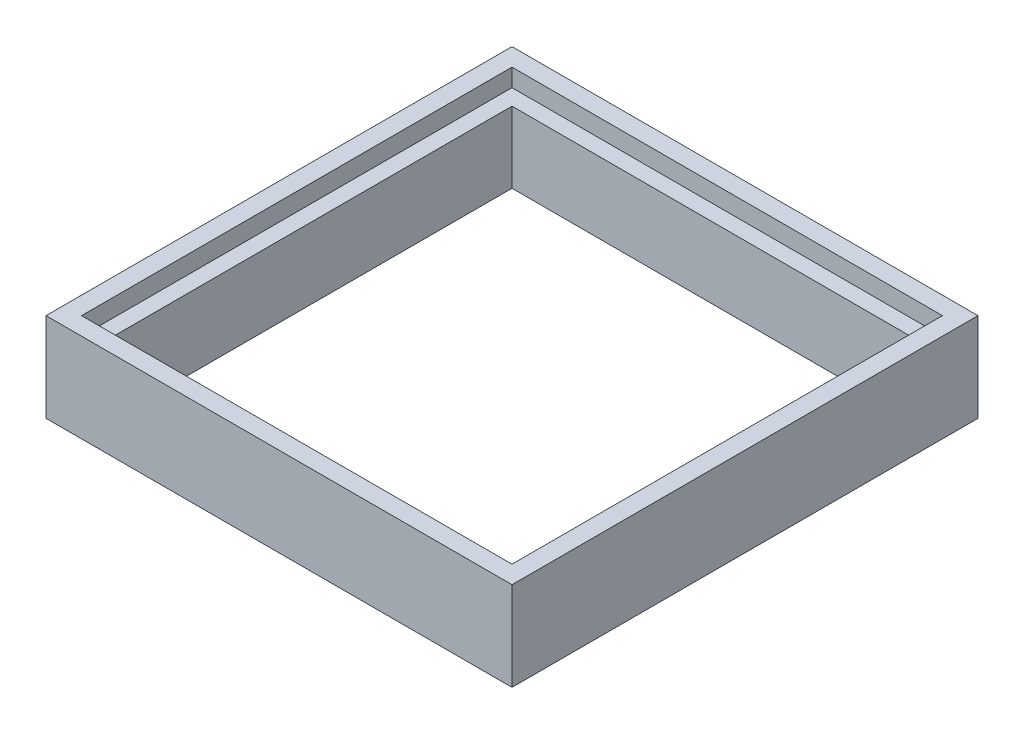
ISO-10303-21;
HEADER;
FILE_DESCRIPTION(('STEP AP214'),'2;1');
FILE_NAME('part.step','',(''),(''),'','','');
FILE_SCHEMA(('AUTOMOTIVE_DESIGN { 1 0 10303 214 1 1 1 1 }'));
ENDSEC;
DATA;
#1=APPLICATION_CONTEXT('core data for automotive mechanical design processes');
#2=APPLICATION_PROTOCOL_DEFINITION('international standard','automotive_design',2000,#1);
#3=PRODUCT_CONTEXT('',#1,'mechanical');
#4=PRODUCT('Part','Part','',(#3));
#5=PRODUCT_RELATED_PRODUCT_CATEGORY('part','',(#4));
#6=PRODUCT_DEFINITION_FORMATION('','',#4);
#7=PRODUCT_DEFINITION_CONTEXT('part definition',#1,'design');
#8=PRODUCT_DEFINITION('design','',#6,#7);
#9=PRODUCT_DEFINITION_SHAPE('','',#8);
#10=(LENGTH_UNIT() NAMED_UNIT(*) SI_UNIT(.MILLI.,.METRE.));
#11=(NAMED_UNIT(*) PLANE_ANGLE_UNIT() SI_UNIT($,.RADIAN.));
#12=(NAMED_UNIT(*) SI_UNIT($,.STERADIAN.) SOLID_ANGLE_UNIT());
#13=UNCERTAINTY_MEASURE_WITH_UNIT(LENGTH_MEASURE(1.E-05),#10,'distance_accuracy_value','');
#14=(GEOMETRIC_REPRESENTATION_CONTEXT(3) GLOBAL_UNCERTAINTY_ASSIGNED_CONTEXT((#13)) GLOBAL_UNIT_ASSIGNED_CONTEXT((#10,
#11,#12)) REPRESENTATION_CONTEXT('',''));
#15=CARTESIAN_POINT('',(0.,0.,0.));
#16=DIRECTION('',(0.,0.,1.));
#17=DIRECTION('',(1.,0.,0.));
#18=AXIS2_PLACEMENT_3D('',#15,#16,#17);
#19=CARTESIAN_POINT('',(14.,6.25,14.));
#20=DIRECTION('',(-1.,0.,0.));
#21=DIRECTION('',(0.,0.,1.));
#22=AXIS2_PLACEMENT_3D('',#19,#20,#21);
#23=PLANE('',#22);
#24=DIRECTION('',(0.,-1.,0.));
#25=VECTOR('',#24,1.);
#26=CARTESIAN_POINT('',(14.,6.25,14.));
#27=LINE('',#26,#25);
#28=CARTESIAN_POINT('',(14.,5.,14.));
#29=VERTEX_POINT('',#28);
#30=CARTESIAN_POINT('',(14.,0.,14.));
#31=VERTEX_POINT('',#30);
#32=EDGE_CURVE('E180',#29,#31,#27,.T.);
#33=ORIENTED_EDGE('',*,*,#32,.F.);
#34=DIRECTION('',(0.,0.,-1.));
#35=VECTOR('',#34,1.);
#36=CARTESIAN_POINT('',(14.,5.,14.));
#37=LINE('',#36,#35);
#38=CARTESIAN_POINT('',(14.,5.,-14.));
#39=VERTEX_POINT('',#38);
#40=EDGE_CURVE('E58',#29,#39,#37,.T.);
#41=ORIENTED_EDGE('',*,*,#40,.T.);
#42=DIRECTION('',(0.,-1.,0.));
#43=VECTOR('',#42,1.);
#44=CARTESIAN_POINT('',(14.,6.25,-14.));
#45=LINE('',#44,#43);
#46=CARTESIAN_POINT('',(14.,0.,-14.));
#47=VERTEX_POINT('',#46);
#48=EDGE_CURVE('E186',#39,#47,#45,.T.);
#49=ORIENTED_EDGE('',*,*,#48,.T.);
#50=DIRECTION('',(0.,0.,-1.));
#51=VECTOR('',#50,1.);
#52=CARTESIAN_POINT('',(14.,0.,14.));
#53=LINE('',#52,#51);
#54=EDGE_CURVE('E168',#31,#47,#53,.T.);
#55=ORIENTED_EDGE('',*,*,#54,.F.);
#56=EDGE_LOOP('',(#33,#41,#49,#55));
#57=FACE_BOUND('',#56,.T.);
#58=ADVANCED_FACE('F35',(#57),#23,.T.);
#59=CARTESIAN_POINT('',(-14.,6.25,-14.));
#60=DIRECTION('',(0.,0.,1.));
#61=DIRECTION('',(1.,0.,0.));
#62=AXIS2_PLACEMENT_3D('',#59,#60,#61);
#63=PLANE('',#62);
#64=ORIENTED_EDGE('',*,*,#48,.F.);
#65=DIRECTION('',(-1.,0.,0.));
#66=VECTOR('',#65,1.);
#67=CARTESIAN_POINT('',(-14.,5.,-14.));
#68=LINE('',#67,#66);
#69=CARTESIAN_POINT('',(-14.,5.,-14.));
#70=VERTEX_POINT('',#69);
#71=EDGE_CURVE('E164',#39,#70,#68,.T.);
#72=ORIENTED_EDGE('',*,*,#71,.T.);
#73=DIRECTION('',(0.,-1.,0.));
#74=VECTOR('',#73,1.);
#75=CARTESIAN_POINT('',(-14.,6.25,-14.));
#76=LINE('',#75,#74);
#77=CARTESIAN_POINT('',(-14.,0.,-14.));
#78=VERTEX_POINT('',#77);
#79=EDGE_CURVE('E184',#70,#78,#76,.T.);
#80=ORIENTED_EDGE('',*,*,#79,.T.);
#81=DIRECTION('',(-1.,0.,0.));
#82=VECTOR('',#81,1.);
#83=CARTESIAN_POINT('',(-14.,0.,-14.));
#84=LINE('',#83,#82);
#85=EDGE_CURVE('E171',#47,#78,#84,.T.);
#86=ORIENTED_EDGE('',*,*,#85,.F.);
#87=EDGE_LOOP('',(#64,#72,#80,#86));
#88=FACE_BOUND('',#87,.T.);
#89=ADVANCED_FACE('F251',(#88),#63,.T.);
#90=CARTESIAN_POINT('',(-14.,6.25,14.));
#91=DIRECTION('',(1.,0.,0.));
#92=DIRECTION('',(0.,0.,-1.));
#93=AXIS2_PLACEMENT_3D('',#90,#91,#92);
#94=PLANE('',#93);
#95=ORIENTED_EDGE('',*,*,#79,.F.);
#96=DIRECTION('',(0.,0.,1.));
#97=VECTOR('',#96,1.);
#98=CARTESIAN_POINT('',(-14.,5.,14.));
#99=LINE('',#98,#97);
#100=CARTESIAN_POINT('',(-14.,5.,14.));
#101=VERTEX_POINT('',#100);
#102=EDGE_CURVE('E158',#70,#101,#99,.T.);
#103=ORIENTED_EDGE('',*,*,#102,.T.);
#104=DIRECTION('',(0.,-1.,0.));
#105=VECTOR('',#104,1.);
#106=CARTESIAN_POINT('',(-14.,6.25,14.));
#107=LINE('',#106,#105);
#108=CARTESIAN_POINT('',(-14.,0.,14.));
#109=VERTEX_POINT('',#108);
#110=EDGE_CURVE('E182',#101,#109,#107,.T.);
#111=ORIENTED_EDGE('',*,*,#110,.T.);
#112=DIRECTION('',(0.,0.,1.));
#113=VECTOR('',#112,1.);
#114=CARTESIAN_POINT('',(-14.,0.,14.));
#115=LINE('',#114,#113);
#116=EDGE_CURVE('E174',#78,#109,#115,.T.);
#117=ORIENTED_EDGE('',*,*,#116,.F.);
#118=EDGE_LOOP('',(#95,#103,#111,#117));
#119=FACE_BOUND('',#118,.T.);
#120=ADVANCED_FACE('F246',(#119),#94,.T.);
#121=CARTESIAN_POINT('',(-14.,6.25,14.));
#122=DIRECTION('',(0.,0.,-1.));
#123=DIRECTION('',(-1.,0.,0.));
#124=AXIS2_PLACEMENT_3D('',#121,#122,#123);
#125=PLANE('',#124);
#126=ORIENTED_EDGE('',*,*,#110,.F.);
#127=DIRECTION('',(1.,0.,0.));
#128=VECTOR('',#127,1.);
#129=CARTESIAN_POINT('',(-14.,5.,14.));
#130=LINE('',#129,#128);
#131=EDGE_CURVE('E11',#101,#29,#130,.T.);
#132=ORIENTED_EDGE('',*,*,#131,.T.);
#133=ORIENTED_EDGE('',*,*,#32,.T.);
#134=DIRECTION('',(1.,0.,0.));
#135=VECTOR('',#134,1.);
#136=CARTESIAN_POINT('',(-14.,0.,14.));
#137=LINE('',#136,#135);
#138=EDGE_CURVE('E177',#109,#31,#137,.T.);
#139=ORIENTED_EDGE('',*,*,#138,.F.);
#140=EDGE_LOOP('',(#126,#132,#133,#139));
#141=FACE_BOUND('',#140,.T.);
#142=ADVANCED_FACE('F238',(#141),#125,.T.);
#143=CARTESIAN_POINT('',(0.,6.25,0.));
#144=DIRECTION('',(0.,-1.,0.));
#145=DIRECTION('',(0.,0.,-1.));
#146=AXIS2_PLACEMENT_3D('',#143,#144,#145);
#147=PLANE('',#146);
#148=DIRECTION('',(-1.,0.,0.));
#149=VECTOR('',#148,1.);
#150=CARTESIAN_POINT('',(15.125,6.25,-15.125));
#151=LINE('',#150,#149);
#152=CARTESIAN_POINT('',(15.125,6.25,-15.125));
#153=VERTEX_POINT('',#152);
#154=CARTESIAN_POINT('',(-15.125,6.25,-15.125));
#155=VERTEX_POINT('',#154);
#156=EDGE_CURVE('E152',#153,#155,#151,.T.);
#157=ORIENTED_EDGE('',*,*,#156,.F.);
#158=DIRECTION('',(0.,0.,-1.));
#159=VECTOR('',#158,1.);
#160=CARTESIAN_POINT('',(15.125,6.25,15.125));
#161=LINE('',#160,#159);
#162=CARTESIAN_POINT('',(15.125,6.25,15.125));
#163=VERTEX_POINT('',#162);
#164=EDGE_CURVE('E50',#163,#153,#161,.T.);
#165=ORIENTED_EDGE('',*,*,#164,.F.);
#166=DIRECTION('',(1.,0.,0.));
#167=VECTOR('',#166,1.);
#168=CARTESIAN_POINT('',(-15.125,6.25,15.125));
#169=LINE('',#168,#167);
#170=CARTESIAN_POINT('',(-15.125,6.25,15.125));
#171=VERTEX_POINT('',#170);
#172=EDGE_CURVE('E143',#171,#163,#169,.T.);
#173=ORIENTED_EDGE('',*,*,#172,.F.);
#174=DIRECTION('',(0.,0.,1.));
#175=VECTOR('',#174,1.);
#176=CARTESIAN_POINT('',(-15.125,6.25,-15.125));
#177=LINE('',#176,#175);
#178=EDGE_CURVE('E146',#155,#171,#177,.T.);
#179=ORIENTED_EDGE('',*,*,#178,.F.);
#180=EDGE_LOOP('',(#157,#165,#173,#179));
#181=FACE_BOUND('',#180,.T.);
#182=DIRECTION('',(0.,0.,1.));
#183=VECTOR('',#182,1.);
#184=CARTESIAN_POINT('',(-16.375,6.25,16.375));
#185=LINE('',#184,#183);
#186=CARTESIAN_POINT('',(-16.375,6.25,-16.375));
#187=VERTEX_POINT('',#186);
#188=CARTESIAN_POINT('',(-16.375,6.25,16.375));
#189=VERTEX_POINT('',#188);
#190=EDGE_CURVE('E189',#187,#189,#185,.T.);
#191=ORIENTED_EDGE('',*,*,#190,.T.);
#192=DIRECTION('',(1.,0.,0.));
#193=VECTOR('',#192,1.);
#194=CARTESIAN_POINT('',(-16.375,6.25,16.375));
#195=LINE('',#194,#193);
#196=CARTESIAN_POINT('',(16.375,6.25,16.375));
#197=VERTEX_POINT('',#196);
#198=EDGE_CURVE('E192',#189,#197,#195,.T.);
#199=ORIENTED_EDGE('',*,*,#198,.T.);
#200=DIRECTION('',(0.,0.,-1.));
#201=VECTOR('',#200,1.);
#202=CARTESIAN_POINT('',(16.375,6.25,16.375));
#203=LINE('',#202,#201);
#204=CARTESIAN_POINT('',(16.375,6.25,-16.375));
#205=VERTEX_POINT('',#204);
#206=EDGE_CURVE('E195',#197,#205,#203,.T.);
#207=ORIENTED_EDGE('',*,*,#206,.T.);
#208=DIRECTION('',(-1.,0.,0.));
#209=VECTOR('',#208,1.);
#210=CARTESIAN_POINT('',(-16.375,6.25,-16.375));
#211=LINE('',#210,#209);
#212=EDGE_CURVE('E197',#205,#187,#211,.T.);
#213=ORIENTED_EDGE('',*,*,#212,.T.);
#214=EDGE_LOOP('',(#191,#199,#207,#213));
#215=FACE_BOUND('',#214,.T.);
#216=ADVANCED_FACE('F236',(#181,#215),#147,.F.);
#217=CARTESIAN_POINT('',(0.,0.,0.));
#218=DIRECTION('',(0.,-1.,0.));
#219=DIRECTION('',(0.,0.,-1.));
#220=AXIS2_PLACEMENT_3D('',#217,#218,#219);
#221=PLANE('',#220);
#222=DIRECTION('',(0.,0.,1.));
#223=VECTOR('',#222,1.);
#224=CARTESIAN_POINT('',(-16.375,0.,16.375));
#225=LINE('',#224,#223);
#226=CARTESIAN_POINT('',(-16.375,0.,-16.375));
#227=VERTEX_POINT('',#226);
#228=CARTESIAN_POINT('',(-16.375,0.,16.375));
#229=VERTEX_POINT('',#228);
#230=EDGE_CURVE('E188',#227,#229,#225,.T.);
#231=ORIENTED_EDGE('',*,*,#230,.F.);
#232=DIRECTION('',(-1.,0.,0.));
#233=VECTOR('',#232,1.);
#234=CARTESIAN_POINT('',(-16.375,0.,-16.375));
#235=LINE('',#234,#233);
#236=CARTESIAN_POINT('',(16.375,0.,-16.375));
#237=VERTEX_POINT('',#236);
#238=EDGE_CURVE('E193',#237,#227,#235,.T.);
#239=ORIENTED_EDGE('',*,*,#238,.F.);
#240=DIRECTION('',(0.,0.,-1.));
#241=VECTOR('',#240,1.);
#242=CARTESIAN_POINT('',(16.375,0.,16.375));
#243=LINE('',#242,#241);
#244=CARTESIAN_POINT('',(16.375,0.,16.375));
#245=VERTEX_POINT('',#244);
#246=EDGE_CURVE('E204',#245,#237,#243,.T.);
#247=ORIENTED_EDGE('',*,*,#246,.F.);
#248=DIRECTION('',(1.,0.,0.));
#249=VECTOR('',#248,1.);
#250=CARTESIAN_POINT('',(-16.375,0.,16.375));
#251=LINE('',#250,#249);
#252=EDGE_CURVE('E202',#229,#245,#251,.T.);
#253=ORIENTED_EDGE('',*,*,#252,.F.);
#254=EDGE_LOOP('',(#231,#239,#247,#253));
#255=FACE_BOUND('',#254,.T.);
#256=ORIENTED_EDGE('',*,*,#138,.T.);
#257=ORIENTED_EDGE('',*,*,#54,.T.);
#258=ORIENTED_EDGE('',*,*,#85,.T.);
#259=ORIENTED_EDGE('',*,*,#116,.T.);
#260=EDGE_LOOP('',(#256,#257,#258,#259));
#261=FACE_BOUND('',#260,.T.);
#262=ADVANCED_FACE('F225',(#255,#261),#221,.T.);
#263=CARTESIAN_POINT('',(-16.375,6.25,16.375));
#264=DIRECTION('',(1.,0.,0.));
#265=DIRECTION('',(0.,0.,-1.));
#266=AXIS2_PLACEMENT_3D('',#263,#264,#265);
#267=PLANE('',#266);
#268=ORIENTED_EDGE('',*,*,#230,.T.);
#269=DIRECTION('',(0.,-1.,0.));
#270=VECTOR('',#269,1.);
#271=CARTESIAN_POINT('',(-16.375,6.25,16.375));
#272=LINE('',#271,#270);
#273=EDGE_CURVE('E43',#189,#229,#272,.T.);
#274=ORIENTED_EDGE('',*,*,#273,.F.);
#275=ORIENTED_EDGE('',*,*,#190,.F.);
#276=DIRECTION('',(0.,-1.,0.));
#277=VECTOR('',#276,1.);
#278=CARTESIAN_POINT('',(-16.375,6.25,-16.375));
#279=LINE('',#278,#277);
#280=EDGE_CURVE('E199',#187,#227,#279,.T.);
#281=ORIENTED_EDGE('',*,*,#280,.T.);
#282=EDGE_LOOP('',(#268,#274,#275,#281));
#283=FACE_BOUND('',#282,.T.);
#284=ADVANCED_FACE('F37',(#283),#267,.F.);
#285=CARTESIAN_POINT('',(-16.375,6.25,16.375));
#286=DIRECTION('',(0.,0.,-1.));
#287=DIRECTION('',(-1.,0.,0.));
#288=AXIS2_PLACEMENT_3D('',#285,#286,#287);
#289=PLANE('',#288);
#290=ORIENTED_EDGE('',*,*,#252,.T.);
#291=DIRECTION('',(0.,-1.,0.));
#292=VECTOR('',#291,1.);
#293=CARTESIAN_POINT('',(16.375,6.25,16.375));
#294=LINE('',#293,#292);
#295=EDGE_CURVE('E212',#197,#245,#294,.T.);
#296=ORIENTED_EDGE('',*,*,#295,.F.);
#297=ORIENTED_EDGE('',*,*,#198,.F.);
#298=ORIENTED_EDGE('',*,*,#273,.T.);
#299=EDGE_LOOP('',(#290,#296,#297,#298));
#300=FACE_BOUND('',#299,.T.);
#301=ADVANCED_FACE('F217',(#300),#289,.F.);
#302=CARTESIAN_POINT('',(16.375,6.25,16.375));
#303=DIRECTION('',(-1.,0.,0.));
#304=DIRECTION('',(0.,0.,1.));
#305=AXIS2_PLACEMENT_3D('',#302,#303,#304);
#306=PLANE('',#305);
#307=ORIENTED_EDGE('',*,*,#246,.T.);
#308=DIRECTION('',(0.,-1.,0.));
#309=VECTOR('',#308,1.);
#310=CARTESIAN_POINT('',(16.375,6.25,-16.375));
#311=LINE('',#310,#309);
#312=EDGE_CURVE('E209',#205,#237,#311,.T.);
#313=ORIENTED_EDGE('',*,*,#312,.F.);
#314=ORIENTED_EDGE('',*,*,#206,.F.);
#315=ORIENTED_EDGE('',*,*,#295,.T.);
#316=EDGE_LOOP('',(#307,#313,#314,#315));
#317=FACE_BOUND('',#316,.T.);
#318=ADVANCED_FACE('F230',(#317),#306,.F.);
#319=CARTESIAN_POINT('',(-16.375,6.25,-16.375));
#320=DIRECTION('',(0.,0.,1.));
#321=DIRECTION('',(1.,0.,0.));
#322=AXIS2_PLACEMENT_3D('',#319,#320,#321);
#323=PLANE('',#322);
#324=ORIENTED_EDGE('',*,*,#238,.T.);
#325=ORIENTED_EDGE('',*,*,#280,.F.);
#326=ORIENTED_EDGE('',*,*,#212,.F.);
#327=ORIENTED_EDGE('',*,*,#312,.T.);
#328=EDGE_LOOP('',(#324,#325,#326,#327));
#329=FACE_BOUND('',#328,.T.);
#330=ADVANCED_FACE('F234',(#329),#323,.F.);
#331=CARTESIAN_POINT('',(15.125,5.,15.125));
#332=DIRECTION('',(1.,0.,0.));
#333=DIRECTION('',(0.,0.,-1.));
#334=AXIS2_PLACEMENT_3D('',#331,#332,#333);
#335=PLANE('',#334);
#336=ORIENTED_EDGE('',*,*,#164,.T.);
#337=DIRECTION('',(0.,1.,0.));
#338=VECTOR('',#337,1.);
#339=CARTESIAN_POINT('',(15.125,5.,-15.125));
#340=LINE('',#339,#338);
#341=CARTESIAN_POINT('',(15.125,5.,-15.125));
#342=VERTEX_POINT('',#341);
#343=EDGE_CURVE('E121',#342,#153,#340,.T.);
#344=ORIENTED_EDGE('',*,*,#343,.F.);
#345=DIRECTION('',(0.,0.,-1.));
#346=VECTOR('',#345,1.);
#347=CARTESIAN_POINT('',(15.125,5.,15.125));
#348=LINE('',#347,#346);
#349=CARTESIAN_POINT('',(15.125,5.,15.125));
#350=VERTEX_POINT('',#349);
#351=EDGE_CURVE('E125',#350,#342,#348,.T.);
#352=ORIENTED_EDGE('',*,*,#351,.F.);
#353=DIRECTION('',(0.,1.,0.));
#354=VECTOR('',#353,1.);
#355=CARTESIAN_POINT('',(15.125,5.,15.125));
#356=LINE('',#355,#354);
#357=EDGE_CURVE('E156',#350,#163,#356,.T.);
#358=ORIENTED_EDGE('',*,*,#357,.T.);
#359=EDGE_LOOP('',(#336,#344,#352,#358));
#360=FACE_BOUND('',#359,.T.);
#361=ADVANCED_FACE('F123',(#360),#335,.F.);
#362=CARTESIAN_POINT('',(-15.125,5.,15.125));
#363=DIRECTION('',(0.,0.,1.));
#364=DIRECTION('',(1.,0.,0.));
#365=AXIS2_PLACEMENT_3D('',#362,#363,#364);
#366=PLANE('',#365);
#367=ORIENTED_EDGE('',*,*,#172,.T.);
#368=ORIENTED_EDGE('',*,*,#357,.F.);
#369=DIRECTION('',(1.,0.,0.));
#370=VECTOR('',#369,1.);
#371=CARTESIAN_POINT('',(-15.125,5.,15.125));
#372=LINE('',#371,#370);
#373=CARTESIAN_POINT('',(-15.125,5.,15.125));
#374=VERTEX_POINT('',#373);
#375=EDGE_CURVE('E131',#374,#350,#372,.T.);
#376=ORIENTED_EDGE('',*,*,#375,.F.);
#377=DIRECTION('',(0.,1.,0.));
#378=VECTOR('',#377,1.);
#379=CARTESIAN_POINT('',(-15.125,5.,15.125));
#380=LINE('',#379,#378);
#381=EDGE_CURVE('E159',#374,#171,#380,.T.);
#382=ORIENTED_EDGE('',*,*,#381,.T.);
#383=EDGE_LOOP('',(#367,#368,#376,#382));
#384=FACE_BOUND('',#383,.T.);
#385=ADVANCED_FACE('F265',(#384),#366,.F.);
#386=CARTESIAN_POINT('',(-15.125,5.,-15.125));
#387=DIRECTION('',(-1.,0.,0.));
#388=DIRECTION('',(0.,0.,1.));
#389=AXIS2_PLACEMENT_3D('',#386,#387,#388);
#390=PLANE('',#389);
#391=ORIENTED_EDGE('',*,*,#178,.T.);
#392=ORIENTED_EDGE('',*,*,#381,.F.);
#393=DIRECTION('',(0.,0.,1.));
#394=VECTOR('',#393,1.);
#395=CARTESIAN_POINT('',(-15.125,5.,-15.125));
#396=LINE('',#395,#394);
#397=CARTESIAN_POINT('',(-15.125,5.,-15.125));
#398=VERTEX_POINT('',#397);
#399=EDGE_CURVE('E139',#398,#374,#396,.T.);
#400=ORIENTED_EDGE('',*,*,#399,.F.);
#401=DIRECTION('',(0.,1.,0.));
#402=VECTOR('',#401,1.);
#403=CARTESIAN_POINT('',(-15.125,5.,-15.125));
#404=LINE('',#403,#402);
#405=EDGE_CURVE('E130',#398,#155,#404,.T.);
#406=ORIENTED_EDGE('',*,*,#405,.T.);
#407=EDGE_LOOP('',(#391,#392,#400,#406));
#408=FACE_BOUND('',#407,.T.);
#409=ADVANCED_FACE('F268',(#408),#390,.F.);
#410=CARTESIAN_POINT('',(15.125,5.,-15.125));
#411=DIRECTION('',(0.,0.,-1.));
#412=DIRECTION('',(-1.,0.,0.));
#413=AXIS2_PLACEMENT_3D('',#410,#411,#412);
#414=PLANE('',#413);
#415=ORIENTED_EDGE('',*,*,#156,.T.);
#416=ORIENTED_EDGE('',*,*,#405,.F.);
#417=DIRECTION('',(-1.,0.,0.));
#418=VECTOR('',#417,1.);
#419=CARTESIAN_POINT('',(15.125,5.,-15.125));
#420=LINE('',#419,#418);
#421=EDGE_CURVE('E134',#342,#398,#420,.T.);
#422=ORIENTED_EDGE('',*,*,#421,.F.);
#423=ORIENTED_EDGE('',*,*,#343,.T.);
#424=EDGE_LOOP('',(#415,#416,#422,#423));
#425=FACE_BOUND('',#424,.T.);
#426=ADVANCED_FACE('F135',(#425),#414,.F.);
#427=CARTESIAN_POINT('',(0.,5.,0.));
#428=DIRECTION('',(0.,1.,0.));
#429=DIRECTION('',(0.,0.,1.));
#430=AXIS2_PLACEMENT_3D('',#427,#428,#429);
#431=PLANE('',#430);
#432=ORIENTED_EDGE('',*,*,#131,.F.);
#433=ORIENTED_EDGE('',*,*,#102,.F.);
#434=ORIENTED_EDGE('',*,*,#71,.F.);
#435=ORIENTED_EDGE('',*,*,#40,.F.);
#436=EDGE_LOOP('',(#432,#433,#434,#435));
#437=FACE_BOUND('',#436,.T.);
#438=ORIENTED_EDGE('',*,*,#351,.T.);
#439=ORIENTED_EDGE('',*,*,#421,.T.);
#440=ORIENTED_EDGE('',*,*,#399,.T.);
#441=ORIENTED_EDGE('',*,*,#375,.T.);
#442=EDGE_LOOP('',(#438,#439,#440,#441));
#443=FACE_BOUND('',#442,.T.);
#444=ADVANCED_FACE('F141',(#437,#443),#431,.T.);
#445=CLOSED_SHELL('',(#58,#89,#120,#142,#216,#262,#284,#301,#318,#330,#361,#385,#409,#426,#444));
#446=MANIFOLD_SOLID_BREP('B2',#445);
#447=ADVANCED_BREP_SHAPE_REPRESENTATION('',(#18,#446),#14);
#448=SHAPE_DEFINITION_REPRESENTATION(#9,#447);
ENDSEC;
END-ISO-10303-21;
